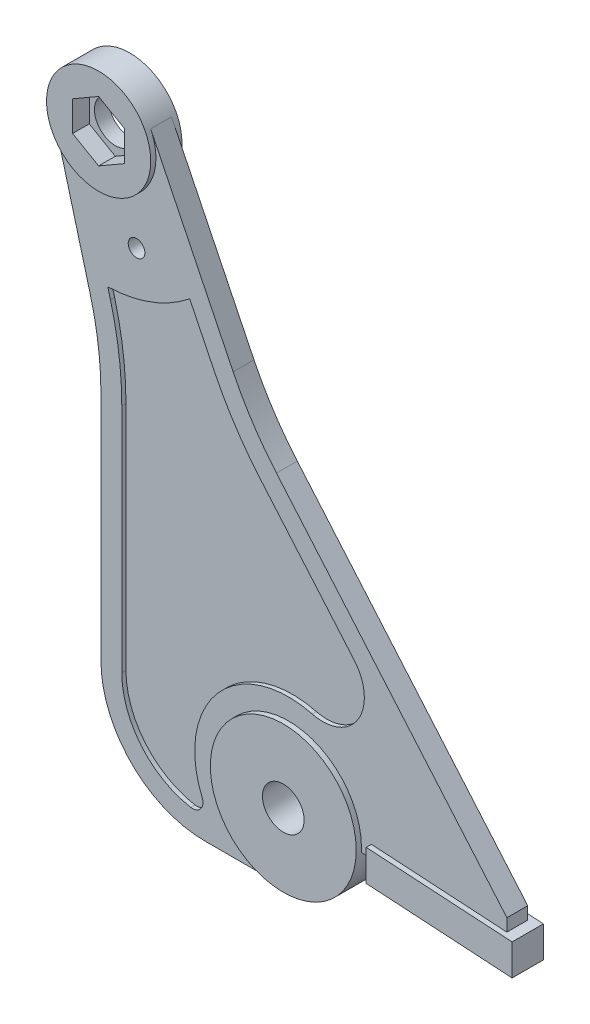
from build123d import *

# Parameters (mm, degrees)
SKETCH1_R           = 4
BOSS_EXTRUDE1_DEPTH = 5
SKETCH2_R           = 35
SKETCH2_R_2         = 10
SKETCH2_R_3         = 25
BOSS_EXTRUDE2_DEPTH = 7.5
BOSS_EXTRUDE3_DEPTH = 7.5
CUT_EXTRUDE1_DEPTH  = 2
CUT_EXTRUDE2_DEPTH  = 8


with BuildPart() as part:
    # Sketch1 → Boss-Extrude1 (new, symmetric)
    with BuildSketch(Plane.XY):
        with BuildLine():
            Line((34.934717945, -2.136698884), (104.804153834, -6.410096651))
            Line((104.804153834, -6.410096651), (104.804153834, 5.589903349))
            Line((104.804153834, 5.589903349), (-5.782057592, 135.069721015))
            ThreePointArc((-5.782057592, 135.069721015), (-17.17104207, 150.253554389), (-26.551391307, 166.754063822))
            Line((-26.551391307, 166.754063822), (-66.138964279, 247.955477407))
            ThreePointArc((-66.138964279, 247.955477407), (-79.855484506, 213.583195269), (-112.757719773, 230.525438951))
            Line((-112.757719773, 230.525438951), (-95.117695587, 164.736491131))
            ThreePointArc((-95.117695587, 164.736491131), (-91.284927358, 145.480632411), (-90, 125.889124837))
            Line((-90, 125.889124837), (-90, 15))
            ThreePointArc((-90, 15), (-75.355339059, -20.355339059), (-40, -35))
            Line((-40, -35), (0, -35))
            ThreePointArc((0, -35), (-23.981404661, 25.492983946), (34.934717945, -2.136698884))
        make_face()
        with Locations((-72.9075125, 195)):
            Circle(SKETCH1_R, mode=Mode.SUBTRACT)
    extrude(amount=BOSS_EXTRUDE1_DEPTH, both=True)

    # Sketch2 → Boss-Extrude2 (add, symmetric)
    # profile 1 of 2: a face of its own
    with BuildSketch(Plane.XY):
        Circle(SKETCH2_R)
        Circle(SKETCH2_R_2, mode=Mode.SUBTRACT)
    # profile 2 of 2: a face of its own
    with BuildSketch(Plane.XY):
        with Locations((-88.610669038, 237)):
            Circle(SKETCH2_R_3)
        with Locations((-88.610669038, 237)):
            Circle(SKETCH2_R_2, mode=Mode.SUBTRACT)
    extrude(amount=BOSS_EXTRUDE2_DEPTH, both=True)

    # Sketch3 → Boss-Extrude3 (add, symmetric)
    with BuildSketch(Plane.XY):
        Polygon((39.804153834, 3.576685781), (39.804153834, -11.423314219), (109.804153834, -15.70469763), (109.804153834, -0.70469763), align=None)
    extrude(amount=BOSS_EXTRUDE3_DEPTH, both=True)

    # Sketch4 → Cut-Extrude1 (cut)
    with BuildSketch(Plane.XY.offset(5)):
        with BuildLine():
            Line((-85.458875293, 167.326315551), (-86.719411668, 172.027520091))
            ThreePointArc((-86.719411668, 172.027520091), (-65.847189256, 176.116307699), (-47.412237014, 186.723870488))
            Line((-47.412237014, 186.723870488), (-35.54007321, 162.371872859))
            ThreePointArc((-35.54007321, 162.371872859), (-25.534367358, 144.771329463), (-13.386117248, 128.575240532))
            Line((-13.386117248, 128.575240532), (31.616622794, 75.88380188))
            ThreePointArc((31.616622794, 75.88380188), (33.358185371, 52.27842514), (11.35973318, 43.542582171))
            ThreePointArc((11.35973318, 43.542582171), (-34.038777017, 29.434022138), (-41.447050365, -17.525467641))
            ThreePointArc((-41.447050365, -17.525467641), (-42.140247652, -22.586584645), (-46.916889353, -24.397419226))
            ThreePointArc((-46.916889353, -24.397419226), (-70.632299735, -10.72279559), (-80, 15))
            Line((-80, 15), (-80, 125.889124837))
            ThreePointArc((-80, 125.889124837), (-81.370589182, 146.786732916), (-85.458875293, 167.326315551))
        make_face()
    cut_extrude1 = extrude(amount=-CUT_EXTRUDE1_DEPTH, mode=Mode.SUBTRACT)

    # Mirror1: Cut-Extrude1 across plane
    add(cut_extrude1.mirror(Plane.XY), mode=Mode.SUBTRACT)

    # Sketch5 → Cut-Extrude2 (cut)
    with BuildSketch(Plane.XY.offset(7.5)):
        Polygon((-88.610669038, 222.56624327), (-76.110669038, 229.783121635), (-76.110669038, 244.216878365), (-88.610669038, 251.43375673), (-101.110669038, 244.216878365), (-101.110669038, 229.783121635), align=None)
    extrude(amount=-CUT_EXTRUDE2_DEPTH, mode=Mode.SUBTRACT)


solid = part.part
